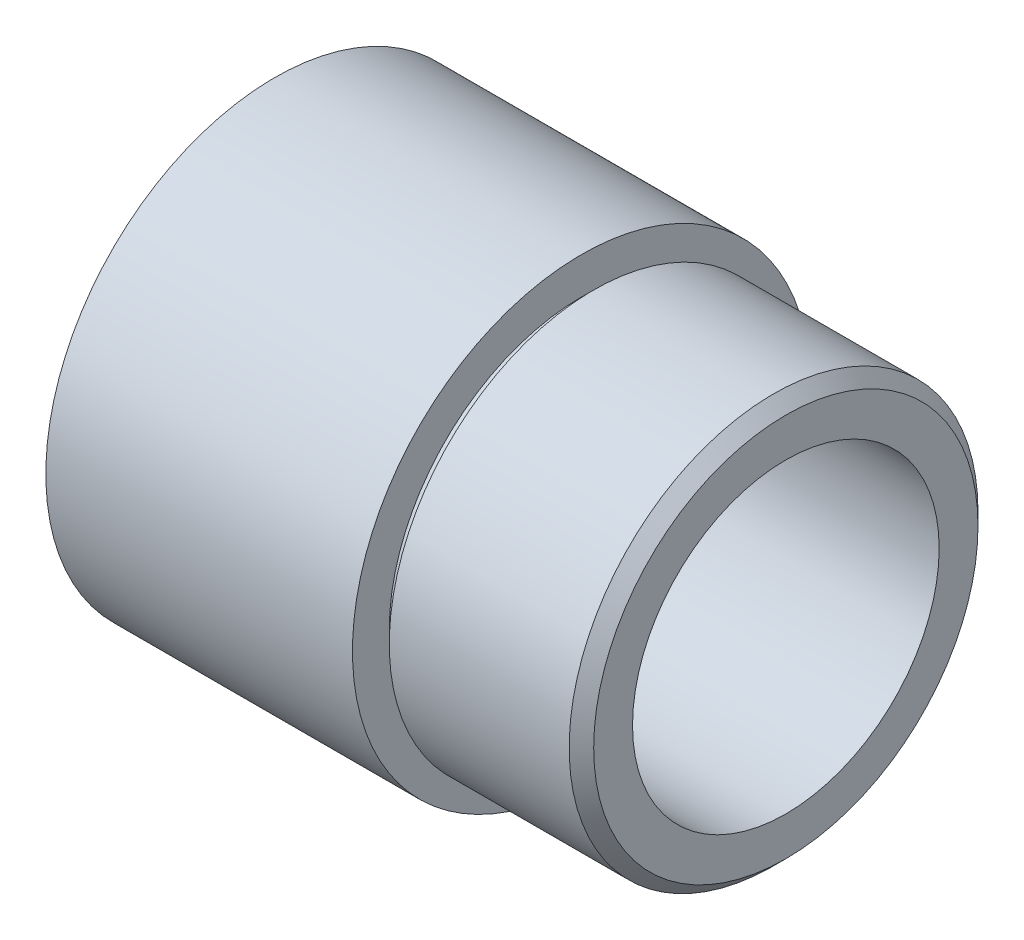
from build123d import *

# Parameters (mm, degrees)
SKETCH2_W = 0.762
SKETCH2_H = 0.762


with BuildPart() as part:
    # Sketch1 → Base-Revolve (revolve)
    with BuildSketch(Plane.XY, mode=Mode.PRIVATE) as base_revolve_sk:
        Polygon((291.97261422, -14.224), (311.02261422, -14.224), (311.02261422, -12.7), (323.72261422, -12.7), (323.72261422, -9.525), (291.97261422, -9.525), align=None)
    revolve(base_revolve_sk.sketch.rotate(Axis((0, 0, 0), (-1, 0, 0)), 270), axis=Axis((0, 0, 0), (-1, 0, 0)))

    # Sketch2 → Cut-Revolve1 (revolve, cut)
    with BuildSketch(Plane.XY, mode=Mode.PRIVATE) as cut_revolve1_sk:
        Polygon((322.96061422, 12.7), (323.72261422, 12.7), (323.72261422, 11.938), align=None)
        with Locations((311.40361422, 12.319)):
            Rectangle(SKETCH2_W, SKETCH2_H)
    revolve(cut_revolve1_sk.sketch.rotate(Axis((0, 0, 0), (-1, 0, 0)), 90), axis=Axis((0, 0, 0), (-1, 0, 0)), mode=Mode.SUBTRACT)


solid = part.part
